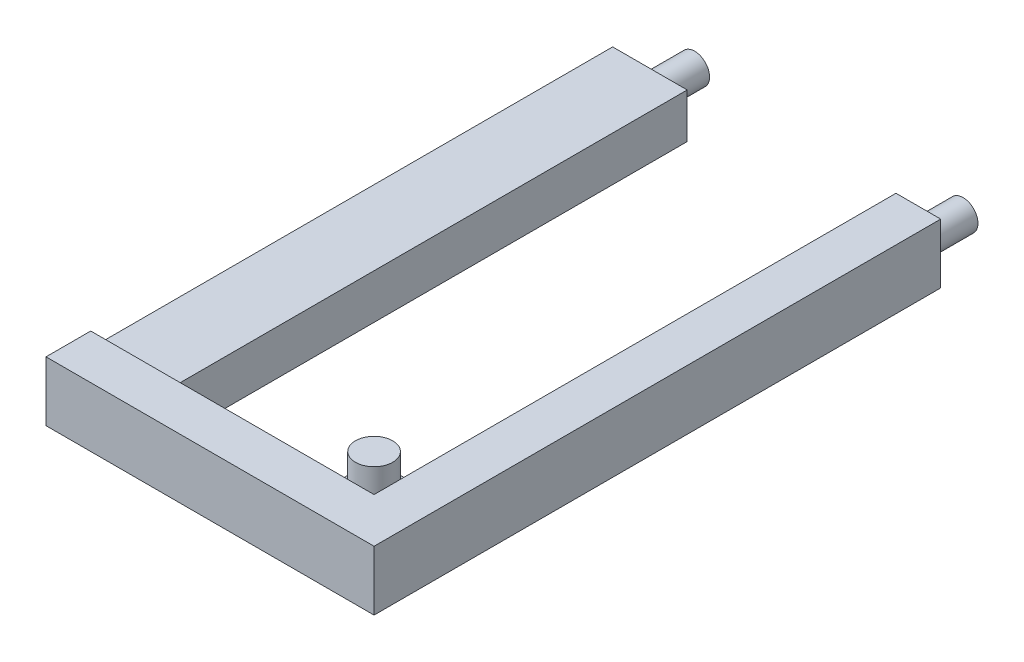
from build123d import *

# Parameters (mm, degrees)
CROQUIS1_W              = 5
CROQUIS1_H              = 35
SALIENTE_EXTRUIR1_DEPTH = 3
CROQUIS3_W              = 19
CROQUIS3_H              = 4
SALIENTE_EXTRUIR2_DEPTH = 3
CROQUIS4_W              = 5
CROQUIS4_H              = 5
SALIENTE_EXTRUIR5_DEPTH = 4
CROQUIS6_W              = 5
CROQUIS6_H              = 5
CROQUIS6_R              = 1.25
CORTAR_EXTRUIR1_DEPTH   = 3
CROQUIS11_W             = 38
CROQUIS11_H             = 4
SALIENTE_EXTRUIR8_DEPTH = 3
CROQUIS12_R             = 1
SALIENTE_EXTRUIR9_DEPTH = 3


with BuildPart() as part:
    # Croquis1 → Saliente-Extruir1 (new body)
    with BuildSketch(Plane(origin=(0, 0, 0), x_dir=(1, 0, 0), z_dir=(0, 1, 0))):
        Rectangle(CROQUIS1_W, CROQUIS1_H)
    extrude(amount=SALIENTE_EXTRUIR1_DEPTH)

    # Croquis3 → Saliente-Extruir2 (add)
    with BuildSketch(Plane.XY.offset(17.5)):
        with Locations((7, 2)):
            Rectangle(CROQUIS3_W, CROQUIS3_H)
    extrude(amount=SALIENTE_EXTRUIR2_DEPTH)

    # Croquis4 → Saliente-Extruir5 (add)
    with BuildSketch(Plane(origin=(0, 4, 0), x_dir=(1, 0, 0), z_dir=(0, 1, 0))):
        with Locations((14, -15)):
            Rectangle(CROQUIS4_W, CROQUIS4_H)
    extrude(amount=-SALIENTE_EXTRUIR5_DEPTH)

    # Croquis6 → Cortar-Extruir1 (cut)
    with BuildSketch(Plane(origin=(0, 4, 0), x_dir=(1, 0, 0), z_dir=(0, 1, 0))):
        with Locations((14, -15)):
            Rectangle(CROQUIS6_W, CROQUIS6_H)
        with Locations(Location((14, -15, 0), (0, 0, 270))):
            Circle(CROQUIS6_R, mode=Mode.SUBTRACT)
    extrude(amount=-CORTAR_EXTRUIR1_DEPTH, mode=Mode.SUBTRACT)

    # Croquis11 → Saliente-Extruir8 (add)
    with BuildSketch(Plane(origin=(16.5, 0, 0), x_dir=(0, 0, -1), z_dir=(1, 0, 0))):
        with Locations((-1.5, 2)):
            Rectangle(CROQUIS11_W, CROQUIS11_H)
    extrude(amount=SALIENTE_EXTRUIR8_DEPTH)

    # Croquis12 → Saliente-Extruir9 (add)
    with BuildSketch(Plane(origin=(0, 0, -17.5), x_dir=(-1, 0, 0), z_dir=(0, 0, -1))):
        with Locations(Location((-18, 2, 0), (0, 0, 180))):
            Circle(CROQUIS12_R)
        with Locations(Location((0, 1.5, 0), (0, 0, 180))):
            Circle(CROQUIS12_R)
    extrude(amount=SALIENTE_EXTRUIR9_DEPTH)


solid = part.part
